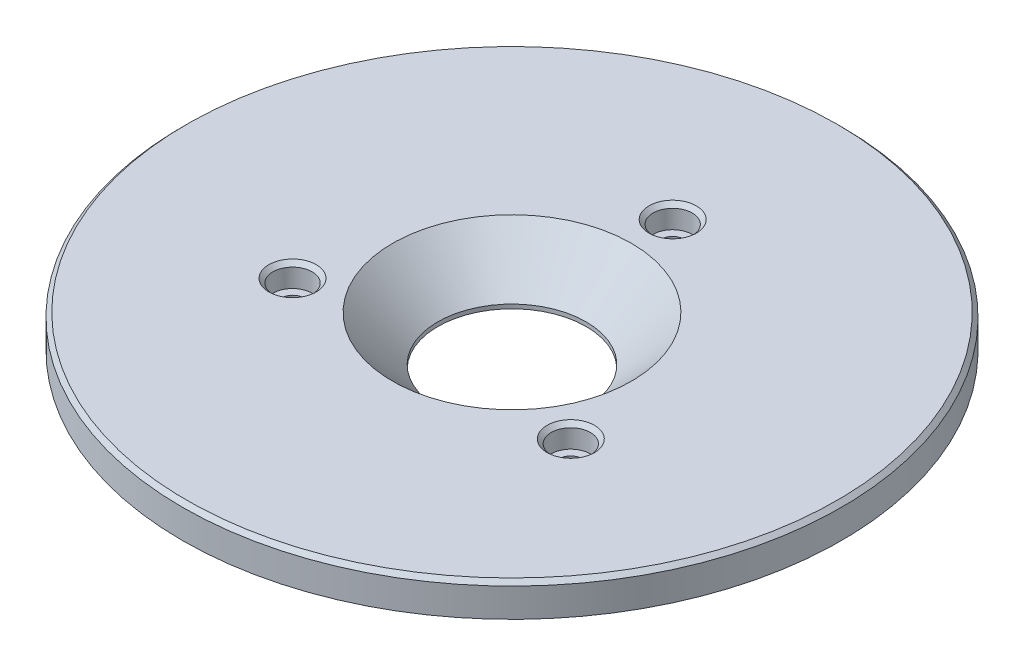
ISO-10303-21;
HEADER;
FILE_DESCRIPTION(('STEP AP214'),'2;1');
FILE_NAME('part.step','',(''),(''),'','','');
FILE_SCHEMA(('AUTOMOTIVE_DESIGN { 1 0 10303 214 1 1 1 1 }'));
ENDSEC;
DATA;
#1=APPLICATION_CONTEXT('core data for automotive mechanical design processes');
#2=APPLICATION_PROTOCOL_DEFINITION('international standard','automotive_design',2000,#1);
#3=PRODUCT_CONTEXT('',#1,'mechanical');
#4=PRODUCT('Part','Part','',(#3));
#5=PRODUCT_RELATED_PRODUCT_CATEGORY('part','',(#4));
#6=PRODUCT_DEFINITION_FORMATION('','',#4);
#7=PRODUCT_DEFINITION_CONTEXT('part definition',#1,'design');
#8=PRODUCT_DEFINITION('design','',#6,#7);
#9=PRODUCT_DEFINITION_SHAPE('','',#8);
#10=(LENGTH_UNIT() NAMED_UNIT(*) SI_UNIT(.MILLI.,.METRE.));
#11=(NAMED_UNIT(*) PLANE_ANGLE_UNIT() SI_UNIT($,.RADIAN.));
#12=(NAMED_UNIT(*) SI_UNIT($,.STERADIAN.) SOLID_ANGLE_UNIT());
#13=UNCERTAINTY_MEASURE_WITH_UNIT(LENGTH_MEASURE(1.E-05),#10,'distance_accuracy_value','');
#14=(GEOMETRIC_REPRESENTATION_CONTEXT(3) GLOBAL_UNCERTAINTY_ASSIGNED_CONTEXT((#13)) GLOBAL_UNIT_ASSIGNED_CONTEXT((#10,
#11,#12)) REPRESENTATION_CONTEXT('',''));
#15=CARTESIAN_POINT('',(0.,0.,0.));
#16=DIRECTION('',(0.,0.,1.));
#17=DIRECTION('',(1.,0.,0.));
#18=AXIS2_PLACEMENT_3D('',#15,#16,#17);
#19=CARTESIAN_POINT('',(-29.,12.,0.));
#20=DIRECTION('',(0.,-1.,0.));
#21=DIRECTION('',(0.,0.,-1.));
#22=AXIS2_PLACEMENT_3D('',#19,#20,#21);
#23=PLANE('',#22);
#24=CARTESIAN_POINT('',(33.7749907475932,12.,19.5));
#25=DIRECTION('',(0.,-1.,0.));
#26=DIRECTION('',(0.,0.,-1.));
#27=AXIS2_PLACEMENT_3D('',#24,#25,#26);
#28=CIRCLE('',#27,5.75);
#29=CARTESIAN_POINT('',(33.7749907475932,12.,13.75));
#30=VERTEX_POINT('',#29);
#31=EDGE_CURVE('E25',#30,#30,#28,.T.);
#32=ORIENTED_EDGE('',*,*,#31,.T.);
#33=EDGE_LOOP('',(#32));
#34=FACE_BOUND('',#33,.T.);
#35=CARTESIAN_POINT('',(0.,12.,-39.));
#36=DIRECTION('',(0.,-1.,0.));
#37=DIRECTION('',(0.,0.,-1.));
#38=AXIS2_PLACEMENT_3D('',#35,#36,#37);
#39=CIRCLE('',#38,5.75);
#40=CARTESIAN_POINT('',(0.,12.,-44.75));
#41=VERTEX_POINT('',#40);
#42=EDGE_CURVE('E29',#41,#41,#39,.T.);
#43=ORIENTED_EDGE('',*,*,#42,.T.);
#44=EDGE_LOOP('',(#43));
#45=FACE_BOUND('',#44,.T.);
#46=CARTESIAN_POINT('',(-33.7749907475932,12.,19.5));
#47=DIRECTION('',(0.,-1.,0.));
#48=DIRECTION('',(0.,0.,-1.));
#49=AXIS2_PLACEMENT_3D('',#46,#47,#48);
#50=CIRCLE('',#49,5.75);
#51=CARTESIAN_POINT('',(-33.7749907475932,12.,13.75));
#52=VERTEX_POINT('',#51);
#53=EDGE_CURVE('E34',#52,#52,#50,.T.);
#54=ORIENTED_EDGE('',*,*,#53,.T.);
#55=EDGE_LOOP('',(#54));
#56=FACE_BOUND('',#55,.T.);
#57=CARTESIAN_POINT('',(0.,12.,0.));
#58=DIRECTION('',(0.,-1.,0.));
#59=DIRECTION('',(0.,0.,-1.));
#60=AXIS2_PLACEMENT_3D('',#57,#58,#59);
#61=CIRCLE('',#60,79.);
#62=CARTESIAN_POINT('',(0.,12.,-79.));
#63=VERTEX_POINT('',#62);
#64=EDGE_CURVE('E58',#63,#63,#61,.F.);
#65=ORIENTED_EDGE('',*,*,#64,.T.);
#66=EDGE_LOOP('',(#65));
#67=FACE_BOUND('',#66,.T.);
#68=CARTESIAN_POINT('',(0.,12.,0.));
#69=DIRECTION('',(0.,-1.,0.));
#70=DIRECTION('',(0.,0.,-1.));
#71=AXIS2_PLACEMENT_3D('',#68,#69,#70);
#72=CIRCLE('',#71,29.);
#73=CARTESIAN_POINT('',(0.,12.,-29.));
#74=VERTEX_POINT('',#73);
#75=EDGE_CURVE('E70',#74,#74,#72,.T.);
#76=ORIENTED_EDGE('',*,*,#75,.T.);
#77=EDGE_LOOP('',(#76));
#78=FACE_BOUND('',#77,.T.);
#79=ADVANCED_FACE('F14',(#34,#45,#56,#67,#78),#23,.F.);
#80=CARTESIAN_POINT('',(0.,1.,0.));
#81=DIRECTION('',(0.,1.,0.));
#82=DIRECTION('',(0.,0.,1.));
#83=AXIS2_PLACEMENT_3D('',#80,#81,#82);
#84=CONICAL_SURFACE('',#83,18.,0.78539816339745);
#85=ORIENTED_EDGE('',*,*,#75,.F.);
#86=EDGE_LOOP('',(#85));
#87=FACE_BOUND('',#86,.T.);
#88=CARTESIAN_POINT('',(0.,1.,0.));
#89=DIRECTION('',(0.,-1.,0.));
#90=DIRECTION('',(0.,0.,-1.));
#91=AXIS2_PLACEMENT_3D('',#88,#89,#90);
#92=CIRCLE('',#91,18.);
#93=CARTESIAN_POINT('',(0.,1.,-18.));
#94=VERTEX_POINT('',#93);
#95=EDGE_CURVE('E83',#94,#94,#92,.T.);
#96=ORIENTED_EDGE('',*,*,#95,.T.);
#97=EDGE_LOOP('',(#96));
#98=FACE_BOUND('',#97,.T.);
#99=ADVANCED_FACE('F123',(#87,#98),#84,.F.);
#100=CARTESIAN_POINT('',(0.,0.,0.));
#101=DIRECTION('',(0.,-1.,0.));
#102=DIRECTION('',(0.,0.,-1.));
#103=AXIS2_PLACEMENT_3D('',#100,#101,#102);
#104=CYLINDRICAL_SURFACE('',#103,18.);
#105=ORIENTED_EDGE('',*,*,#95,.F.);
#106=EDGE_LOOP('',(#105));
#107=FACE_BOUND('',#106,.T.);
#108=CARTESIAN_POINT('',(0.,0.,0.));
#109=DIRECTION('',(0.,-1.,0.));
#110=DIRECTION('',(0.,0.,-1.));
#111=AXIS2_PLACEMENT_3D('',#108,#109,#110);
#112=CIRCLE('',#111,18.);
#113=CARTESIAN_POINT('',(0.,0.,-18.));
#114=VERTEX_POINT('',#113);
#115=EDGE_CURVE('E86',#114,#114,#112,.T.);
#116=ORIENTED_EDGE('',*,*,#115,.T.);
#117=EDGE_LOOP('',(#116));
#118=FACE_BOUND('',#117,.T.);
#119=ADVANCED_FACE('F130',(#107,#118),#104,.F.);
#120=CARTESIAN_POINT('',(-18.,0.,0.));
#121=DIRECTION('',(0.,1.,0.));
#122=DIRECTION('',(0.,0.,1.));
#123=AXIS2_PLACEMENT_3D('',#120,#121,#122);
#124=PLANE('',#123);
#125=CARTESIAN_POINT('',(-33.7749907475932,0.,19.5));
#126=DIRECTION('',(0.,1.,0.));
#127=DIRECTION('',(0.,0.,1.));
#128=AXIS2_PLACEMENT_3D('',#125,#126,#127);
#129=CIRCLE('',#128,3.75);
#130=CARTESIAN_POINT('',(-33.7749907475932,0.,23.25));
#131=VERTEX_POINT('',#130);
#132=EDGE_CURVE('E49',#131,#131,#129,.T.);
#133=ORIENTED_EDGE('',*,*,#132,.T.);
#134=EDGE_LOOP('',(#133));
#135=FACE_BOUND('',#134,.T.);
#136=CARTESIAN_POINT('',(33.7749907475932,0.,19.5));
#137=DIRECTION('',(0.,1.,0.));
#138=DIRECTION('',(0.,0.,1.));
#139=AXIS2_PLACEMENT_3D('',#136,#137,#138);
#140=CIRCLE('',#139,3.75);
#141=CARTESIAN_POINT('',(33.7749907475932,0.,23.25));
#142=VERTEX_POINT('',#141);
#143=EDGE_CURVE('E52',#142,#142,#140,.T.);
#144=ORIENTED_EDGE('',*,*,#143,.T.);
#145=EDGE_LOOP('',(#144));
#146=FACE_BOUND('',#145,.T.);
#147=CARTESIAN_POINT('',(0.,0.,-39.));
#148=DIRECTION('',(0.,1.,0.));
#149=DIRECTION('',(0.,0.,1.));
#150=AXIS2_PLACEMENT_3D('',#147,#148,#149);
#151=CIRCLE('',#150,3.75);
#152=CARTESIAN_POINT('',(0.,0.,-35.25));
#153=VERTEX_POINT('',#152);
#154=EDGE_CURVE('E55',#153,#153,#151,.T.);
#155=ORIENTED_EDGE('',*,*,#154,.T.);
#156=EDGE_LOOP('',(#155));
#157=FACE_BOUND('',#156,.T.);
#158=CARTESIAN_POINT('',(0.,0.,0.));
#159=DIRECTION('',(0.,1.,0.));
#160=DIRECTION('',(0.,0.,1.));
#161=AXIS2_PLACEMENT_3D('',#158,#159,#160);
#162=CIRCLE('',#161,44.);
#163=CARTESIAN_POINT('',(0.,0.,44.));
#164=VERTEX_POINT('',#163);
#165=EDGE_CURVE('E67',#164,#164,#162,.F.);
#166=ORIENTED_EDGE('',*,*,#165,.T.);
#167=EDGE_LOOP('',(#166));
#168=FACE_BOUND('',#167,.T.);
#169=ORIENTED_EDGE('',*,*,#115,.F.);
#170=EDGE_LOOP('',(#169));
#171=FACE_BOUND('',#170,.T.);
#172=ADVANCED_FACE('F181',(#135,#146,#157,#168,#171),#124,.F.);
#173=CARTESIAN_POINT('',(0.,0.,0.));
#174=DIRECTION('',(0.,-1.,0.));
#175=DIRECTION('',(0.,0.,-1.));
#176=AXIS2_PLACEMENT_3D('',#173,#174,#175);
#177=CYLINDRICAL_SURFACE('',#176,45.);
#178=CARTESIAN_POINT('',(0.,1.00000000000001,0.));
#179=DIRECTION('',(0.,1.,0.));
#180=DIRECTION('',(0.,0.,1.));
#181=AXIS2_PLACEMENT_3D('',#178,#179,#180);
#182=CIRCLE('',#181,45.);
#183=CARTESIAN_POINT('',(0.,1.00000000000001,45.));
#184=VERTEX_POINT('',#183);
#185=EDGE_CURVE('E64',#184,#184,#182,.T.);
#186=ORIENTED_EDGE('',*,*,#185,.T.);
#187=EDGE_LOOP('',(#186));
#188=FACE_BOUND('',#187,.T.);
#189=CARTESIAN_POINT('',(0.,4.,0.));
#190=DIRECTION('',(0.,-1.,0.));
#191=DIRECTION('',(0.,0.,-1.));
#192=AXIS2_PLACEMENT_3D('',#189,#190,#191);
#193=CIRCLE('',#192,45.);
#194=CARTESIAN_POINT('',(0.,4.,-45.));
#195=VERTEX_POINT('',#194);
#196=EDGE_CURVE('E89',#195,#195,#193,.T.);
#197=ORIENTED_EDGE('',*,*,#196,.T.);
#198=EDGE_LOOP('',(#197));
#199=FACE_BOUND('',#198,.T.);
#200=ADVANCED_FACE('F185',(#188,#199),#177,.T.);
#201=CARTESIAN_POINT('',(-45.,4.,0.));
#202=DIRECTION('',(0.,1.,0.));
#203=DIRECTION('',(0.,0.,1.));
#204=AXIS2_PLACEMENT_3D('',#201,#202,#203);
#205=PLANE('',#204);
#206=ORIENTED_EDGE('',*,*,#196,.F.);
#207=EDGE_LOOP('',(#206));
#208=FACE_BOUND('',#207,.T.);
#209=CARTESIAN_POINT('',(0.,4.,0.));
#210=DIRECTION('',(0.,-1.,0.));
#211=DIRECTION('',(0.,0.,-1.));
#212=AXIS2_PLACEMENT_3D('',#209,#210,#211);
#213=CIRCLE('',#212,80.);
#214=CARTESIAN_POINT('',(0.,4.,-80.));
#215=VERTEX_POINT('',#214);
#216=EDGE_CURVE('E92',#215,#215,#213,.T.);
#217=ORIENTED_EDGE('',*,*,#216,.T.);
#218=EDGE_LOOP('',(#217));
#219=FACE_BOUND('',#218,.T.);
#220=ADVANCED_FACE('F192',(#208,#219),#205,.F.);
#221=CARTESIAN_POINT('',(0.,0.,0.));
#222=DIRECTION('',(0.,-1.,0.));
#223=DIRECTION('',(0.,0.,-1.));
#224=AXIS2_PLACEMENT_3D('',#221,#222,#223);
#225=CYLINDRICAL_SURFACE('',#224,80.);
#226=CARTESIAN_POINT('',(0.,11.,0.));
#227=DIRECTION('',(0.,-1.,0.));
#228=DIRECTION('',(0.,0.,-1.));
#229=AXIS2_PLACEMENT_3D('',#226,#227,#228);
#230=CIRCLE('',#229,80.);
#231=CARTESIAN_POINT('',(0.,11.,-80.));
#232=VERTEX_POINT('',#231);
#233=EDGE_CURVE('E61',#232,#232,#230,.T.);
#234=ORIENTED_EDGE('',*,*,#233,.T.);
#235=EDGE_LOOP('',(#234));
#236=FACE_BOUND('',#235,.T.);
#237=ORIENTED_EDGE('',*,*,#216,.F.);
#238=EDGE_LOOP('',(#237));
#239=FACE_BOUND('',#238,.T.);
#240=ADVANCED_FACE('F199',(#236,#239),#225,.T.);
#241=CARTESIAN_POINT('',(33.7749907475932,6.5,19.5));
#242=DIRECTION('',(0.,1.,0.));
#243=DIRECTION('',(0.,0.,1.));
#244=AXIS2_PLACEMENT_3D('',#241,#242,#243);
#245=CYLINDRICAL_SURFACE('',#244,4.75);
#246=CARTESIAN_POINT('',(33.7749907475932,11.,19.5));
#247=DIRECTION('',(0.,-1.,0.));
#248=DIRECTION('',(0.,0.,-1.));
#249=AXIS2_PLACEMENT_3D('',#246,#247,#248);
#250=CIRCLE('',#249,4.75);
#251=CARTESIAN_POINT('',(33.7749907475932,11.,14.75));
#252=VERTEX_POINT('',#251);
#253=EDGE_CURVE('E37',#252,#252,#250,.F.);
#254=ORIENTED_EDGE('',*,*,#253,.T.);
#255=EDGE_LOOP('',(#254));
#256=FACE_BOUND('',#255,.T.);
#257=CARTESIAN_POINT('',(33.7749907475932,6.5,19.5));
#258=DIRECTION('',(0.,1.,0.));
#259=DIRECTION('',(0.,0.,-1.));
#260=AXIS2_PLACEMENT_3D('',#257,#258,#259);
#261=CIRCLE('',#260,4.75);
#262=CARTESIAN_POINT('',(33.7749907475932,6.5,14.75));
#263=VERTEX_POINT('',#262);
#264=EDGE_CURVE('E74',#263,#263,#261,.T.);
#265=ORIENTED_EDGE('',*,*,#264,.F.);
#266=EDGE_LOOP('',(#265));
#267=FACE_BOUND('',#266,.T.);
#268=ADVANCED_FACE('F203',(#256,#267),#245,.F.);
#269=CARTESIAN_POINT('',(33.7749907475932,6.5,19.5));
#270=DIRECTION('',(0.,-1.,0.));
#271=DIRECTION('',(0.,0.,-1.));
#272=AXIS2_PLACEMENT_3D('',#269,#270,#271);
#273=PLANE('',#272);
#274=CARTESIAN_POINT('',(33.7749907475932,6.5,19.5));
#275=DIRECTION('',(0.,-1.,0.));
#276=DIRECTION('',(0.,0.,-1.));
#277=AXIS2_PLACEMENT_3D('',#274,#275,#276);
#278=CIRCLE('',#277,2.75);
#279=CARTESIAN_POINT('',(33.7749907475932,6.5,16.75));
#280=VERTEX_POINT('',#279);
#281=EDGE_CURVE('E71',#280,#280,#278,.T.);
#282=ORIENTED_EDGE('',*,*,#281,.T.);
#283=EDGE_LOOP('',(#282));
#284=FACE_BOUND('',#283,.T.);
#285=ORIENTED_EDGE('',*,*,#264,.T.);
#286=EDGE_LOOP('',(#285));
#287=FACE_BOUND('',#286,.T.);
#288=ADVANCED_FACE('F207',(#284,#287),#273,.F.);
#289=CARTESIAN_POINT('',(-33.7749907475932,6.5,19.5));
#290=DIRECTION('',(0.,1.,0.));
#291=DIRECTION('',(0.,0.,1.));
#292=AXIS2_PLACEMENT_3D('',#289,#290,#291);
#293=CYLINDRICAL_SURFACE('',#292,4.75);
#294=CARTESIAN_POINT('',(-33.7749907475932,11.,19.5));
#295=DIRECTION('',(0.,-1.,0.));
#296=DIRECTION('',(0.,0.,-1.));
#297=AXIS2_PLACEMENT_3D('',#294,#295,#296);
#298=CIRCLE('',#297,4.75);
#299=CARTESIAN_POINT('',(-33.7749907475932,11.,14.75));
#300=VERTEX_POINT('',#299);
#301=EDGE_CURVE('E9',#300,#300,#298,.F.);
#302=ORIENTED_EDGE('',*,*,#301,.T.);
#303=EDGE_LOOP('',(#302));
#304=FACE_BOUND('',#303,.T.);
#305=CARTESIAN_POINT('',(-33.7749907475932,6.5,19.5));
#306=DIRECTION('',(0.,1.,0.));
#307=DIRECTION('',(0.,0.,1.));
#308=AXIS2_PLACEMENT_3D('',#305,#306,#307);
#309=CIRCLE('',#308,4.75);
#310=CARTESIAN_POINT('',(-33.7749907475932,6.5,24.25));
#311=VERTEX_POINT('',#310);
#312=EDGE_CURVE('E98',#311,#311,#309,.T.);
#313=ORIENTED_EDGE('',*,*,#312,.F.);
#314=EDGE_LOOP('',(#313));
#315=FACE_BOUND('',#314,.T.);
#316=ADVANCED_FACE('F119',(#304,#315),#293,.F.);
#317=CARTESIAN_POINT('',(-33.7749907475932,6.5,19.5));
#318=DIRECTION('',(0.,1.,0.));
#319=DIRECTION('',(0.,0.,1.));
#320=AXIS2_PLACEMENT_3D('',#317,#318,#319);
#321=PLANE('',#320);
#322=CARTESIAN_POINT('',(-33.7749907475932,6.5,19.5));
#323=DIRECTION('',(0.,1.,0.));
#324=DIRECTION('',(0.,0.,1.));
#325=AXIS2_PLACEMENT_3D('',#322,#323,#324);
#326=CIRCLE('',#325,2.75);
#327=CARTESIAN_POINT('',(-33.7749907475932,6.5,22.25));
#328=VERTEX_POINT('',#327);
#329=EDGE_CURVE('E75',#328,#328,#326,.T.);
#330=ORIENTED_EDGE('',*,*,#329,.F.);
#331=EDGE_LOOP('',(#330));
#332=FACE_BOUND('',#331,.T.);
#333=ORIENTED_EDGE('',*,*,#312,.T.);
#334=EDGE_LOOP('',(#333));
#335=FACE_BOUND('',#334,.T.);
#336=ADVANCED_FACE('F108',(#332,#335),#321,.T.);
#337=CARTESIAN_POINT('',(0.,6.5,-39.));
#338=DIRECTION('',(0.,1.,0.));
#339=DIRECTION('',(0.,0.,1.));
#340=AXIS2_PLACEMENT_3D('',#337,#338,#339);
#341=CYLINDRICAL_SURFACE('',#340,4.75);
#342=CARTESIAN_POINT('',(0.,11.,-39.));
#343=DIRECTION('',(0.,-1.,0.));
#344=DIRECTION('',(0.,0.,-1.));
#345=AXIS2_PLACEMENT_3D('',#342,#343,#344);
#346=CIRCLE('',#345,4.75);
#347=CARTESIAN_POINT('',(0.,11.,-43.75));
#348=VERTEX_POINT('',#347);
#349=EDGE_CURVE('E21',#348,#348,#346,.F.);
#350=ORIENTED_EDGE('',*,*,#349,.T.);
#351=EDGE_LOOP('',(#350));
#352=FACE_BOUND('',#351,.T.);
#353=CARTESIAN_POINT('',(0.,6.5,-39.));
#354=DIRECTION('',(0.,1.,0.));
#355=DIRECTION('',(0.,0.,1.));
#356=AXIS2_PLACEMENT_3D('',#353,#354,#355);
#357=CIRCLE('',#356,4.75);
#358=CARTESIAN_POINT('',(0.,6.5,-34.25));
#359=VERTEX_POINT('',#358);
#360=EDGE_CURVE('E95',#359,#359,#357,.T.);
#361=ORIENTED_EDGE('',*,*,#360,.F.);
#362=EDGE_LOOP('',(#361));
#363=FACE_BOUND('',#362,.T.);
#364=ADVANCED_FACE('F106',(#352,#363),#341,.F.);
#365=CARTESIAN_POINT('',(0.,6.5,-39.));
#366=DIRECTION('',(0.,1.,0.));
#367=DIRECTION('',(0.,0.,1.));
#368=AXIS2_PLACEMENT_3D('',#365,#366,#367);
#369=PLANE('',#368);
#370=CARTESIAN_POINT('',(0.,6.5,-39.));
#371=DIRECTION('',(0.,1.,0.));
#372=DIRECTION('',(0.,0.,1.));
#373=AXIS2_PLACEMENT_3D('',#370,#371,#372);
#374=CIRCLE('',#373,2.75);
#375=CARTESIAN_POINT('',(0.,6.5,-36.25));
#376=VERTEX_POINT('',#375);
#377=EDGE_CURVE('E78',#376,#376,#374,.T.);
#378=ORIENTED_EDGE('',*,*,#377,.F.);
#379=EDGE_LOOP('',(#378));
#380=FACE_BOUND('',#379,.T.);
#381=ORIENTED_EDGE('',*,*,#360,.T.);
#382=EDGE_LOOP('',(#381));
#383=FACE_BOUND('',#382,.T.);
#384=ADVANCED_FACE('F104',(#380,#383),#369,.T.);
#385=CARTESIAN_POINT('',(0.,0.,-39.));
#386=DIRECTION('',(0.,1.,0.));
#387=DIRECTION('',(0.,0.,1.));
#388=AXIS2_PLACEMENT_3D('',#385,#386,#387);
#389=CYLINDRICAL_SURFACE('',#388,2.75);
#390=CARTESIAN_POINT('',(0.,1.,-39.));
#391=DIRECTION('',(0.,1.,0.));
#392=DIRECTION('',(0.,0.,1.));
#393=AXIS2_PLACEMENT_3D('',#390,#391,#392);
#394=CIRCLE('',#393,2.75);
#395=CARTESIAN_POINT('',(0.,1.,-36.25));
#396=VERTEX_POINT('',#395);
#397=EDGE_CURVE('E40',#396,#396,#394,.F.);
#398=ORIENTED_EDGE('',*,*,#397,.T.);
#399=EDGE_LOOP('',(#398));
#400=FACE_BOUND('',#399,.T.);
#401=ORIENTED_EDGE('',*,*,#377,.T.);
#402=EDGE_LOOP('',(#401));
#403=FACE_BOUND('',#402,.T.);
#404=ADVANCED_FACE('F116',(#400,#403),#389,.F.);
#405=CARTESIAN_POINT('',(-33.7749907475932,0.,19.5));
#406=DIRECTION('',(0.,1.,0.));
#407=DIRECTION('',(0.,0.,1.));
#408=AXIS2_PLACEMENT_3D('',#405,#406,#407);
#409=CYLINDRICAL_SURFACE('',#408,2.75);
#410=CARTESIAN_POINT('',(-33.7749907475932,1.,19.5));
#411=DIRECTION('',(0.,1.,0.));
#412=DIRECTION('',(0.,0.,1.));
#413=AXIS2_PLACEMENT_3D('',#410,#411,#412);
#414=CIRCLE('',#413,2.75);
#415=CARTESIAN_POINT('',(-33.7749907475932,1.,22.25));
#416=VERTEX_POINT('',#415);
#417=EDGE_CURVE('E46',#416,#416,#414,.F.);
#418=ORIENTED_EDGE('',*,*,#417,.T.);
#419=EDGE_LOOP('',(#418));
#420=FACE_BOUND('',#419,.T.);
#421=ORIENTED_EDGE('',*,*,#329,.T.);
#422=EDGE_LOOP('',(#421));
#423=FACE_BOUND('',#422,.T.);
#424=ADVANCED_FACE('F338',(#420,#423),#409,.F.);
#425=CARTESIAN_POINT('',(33.7749907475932,0.,19.5));
#426=DIRECTION('',(0.,1.,0.));
#427=DIRECTION('',(0.,0.,1.));
#428=AXIS2_PLACEMENT_3D('',#425,#426,#427);
#429=CYLINDRICAL_SURFACE('',#428,2.75);
#430=CARTESIAN_POINT('',(33.7749907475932,1.,19.5));
#431=DIRECTION('',(0.,1.,0.));
#432=DIRECTION('',(0.,0.,1.));
#433=AXIS2_PLACEMENT_3D('',#430,#431,#432);
#434=CIRCLE('',#433,2.75);
#435=CARTESIAN_POINT('',(33.7749907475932,1.,22.25));
#436=VERTEX_POINT('',#435);
#437=EDGE_CURVE('E43',#436,#436,#434,.F.);
#438=ORIENTED_EDGE('',*,*,#437,.T.);
#439=EDGE_LOOP('',(#438));
#440=FACE_BOUND('',#439,.T.);
#441=ORIENTED_EDGE('',*,*,#281,.F.);
#442=EDGE_LOOP('',(#441));
#443=FACE_BOUND('',#442,.T.);
#444=ADVANCED_FACE('F140',(#440,#443),#429,.F.);
#445=CARTESIAN_POINT('',(0.,0.,0.));
#446=DIRECTION('',(0.,1.,0.));
#447=DIRECTION('',(0.,0.,1.));
#448=AXIS2_PLACEMENT_3D('',#445,#446,#447);
#449=CONICAL_SURFACE('',#448,44.,0.785398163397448);
#450=ORIENTED_EDGE('',*,*,#185,.F.);
#451=EDGE_LOOP('',(#450));
#452=FACE_BOUND('',#451,.T.);
#453=ORIENTED_EDGE('',*,*,#165,.F.);
#454=EDGE_LOOP('',(#453));
#455=FACE_BOUND('',#454,.T.);
#456=ADVANCED_FACE('F136',(#452,#455),#449,.T.);
#457=CARTESIAN_POINT('',(0.,11.,0.));
#458=DIRECTION('',(0.,-1.,0.));
#459=DIRECTION('',(0.,0.,-1.));
#460=AXIS2_PLACEMENT_3D('',#457,#458,#459);
#461=CONICAL_SURFACE('',#460,80.,0.785398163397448);
#462=ORIENTED_EDGE('',*,*,#64,.F.);
#463=EDGE_LOOP('',(#462));
#464=FACE_BOUND('',#463,.T.);
#465=ORIENTED_EDGE('',*,*,#233,.F.);
#466=EDGE_LOOP('',(#465));
#467=FACE_BOUND('',#466,.T.);
#468=ADVANCED_FACE('F139',(#464,#467),#461,.T.);
#469=CARTESIAN_POINT('',(-33.7749907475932,0.,19.5));
#470=DIRECTION('',(0.,-1.,0.));
#471=DIRECTION('',(0.,0.,-1.));
#472=AXIS2_PLACEMENT_3D('',#469,#470,#471);
#473=CONICAL_SURFACE('',#472,3.75,0.785398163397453);
#474=ORIENTED_EDGE('',*,*,#417,.F.);
#475=EDGE_LOOP('',(#474));
#476=FACE_BOUND('',#475,.T.);
#477=ORIENTED_EDGE('',*,*,#132,.F.);
#478=EDGE_LOOP('',(#477));
#479=FACE_BOUND('',#478,.T.);
#480=ADVANCED_FACE('F144',(#476,#479),#473,.F.);
#481=CARTESIAN_POINT('',(33.7749907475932,0.,19.5));
#482=DIRECTION('',(0.,-1.,0.));
#483=DIRECTION('',(0.,0.,-1.));
#484=AXIS2_PLACEMENT_3D('',#481,#482,#483);
#485=CONICAL_SURFACE('',#484,3.75,0.785398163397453);
#486=ORIENTED_EDGE('',*,*,#437,.F.);
#487=EDGE_LOOP('',(#486));
#488=FACE_BOUND('',#487,.T.);
#489=ORIENTED_EDGE('',*,*,#143,.F.);
#490=EDGE_LOOP('',(#489));
#491=FACE_BOUND('',#490,.T.);
#492=ADVANCED_FACE('F148',(#488,#491),#485,.F.);
#493=CARTESIAN_POINT('',(0.,0.,-39.));
#494=DIRECTION('',(0.,-1.,0.));
#495=DIRECTION('',(0.,0.,-1.));
#496=AXIS2_PLACEMENT_3D('',#493,#494,#495);
#497=CONICAL_SURFACE('',#496,3.75,0.785398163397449);
#498=ORIENTED_EDGE('',*,*,#397,.F.);
#499=EDGE_LOOP('',(#498));
#500=FACE_BOUND('',#499,.T.);
#501=ORIENTED_EDGE('',*,*,#154,.F.);
#502=EDGE_LOOP('',(#501));
#503=FACE_BOUND('',#502,.T.);
#504=ADVANCED_FACE('F152',(#500,#503),#497,.F.);
#505=CARTESIAN_POINT('',(33.7749907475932,11.,19.5));
#506=DIRECTION('',(0.,1.,0.));
#507=DIRECTION('',(0.,0.,1.));
#508=AXIS2_PLACEMENT_3D('',#505,#506,#507);
#509=CONICAL_SURFACE('',#508,4.75,0.785398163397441);
#510=ORIENTED_EDGE('',*,*,#31,.F.);
#511=EDGE_LOOP('',(#510));
#512=FACE_BOUND('',#511,.T.);
#513=ORIENTED_EDGE('',*,*,#253,.F.);
#514=EDGE_LOOP('',(#513));
#515=FACE_BOUND('',#514,.T.);
#516=ADVANCED_FACE('F156',(#512,#515),#509,.F.);
#517=CARTESIAN_POINT('',(0.,11.,-39.));
#518=DIRECTION('',(0.,1.,0.));
#519=DIRECTION('',(0.,0.,1.));
#520=AXIS2_PLACEMENT_3D('',#517,#518,#519);
#521=CONICAL_SURFACE('',#520,4.75,0.785398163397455);
#522=ORIENTED_EDGE('',*,*,#42,.F.);
#523=EDGE_LOOP('',(#522));
#524=FACE_BOUND('',#523,.T.);
#525=ORIENTED_EDGE('',*,*,#349,.F.);
#526=EDGE_LOOP('',(#525));
#527=FACE_BOUND('',#526,.T.);
#528=ADVANCED_FACE('F159',(#524,#527),#521,.F.);
#529=CARTESIAN_POINT('',(-33.7749907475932,11.,19.5));
#530=DIRECTION('',(0.,1.,0.));
#531=DIRECTION('',(0.,0.,1.));
#532=AXIS2_PLACEMENT_3D('',#529,#530,#531);
#533=CONICAL_SURFACE('',#532,4.75,0.785398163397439);
#534=ORIENTED_EDGE('',*,*,#53,.F.);
#535=EDGE_LOOP('',(#534));
#536=FACE_BOUND('',#535,.T.);
#537=ORIENTED_EDGE('',*,*,#301,.F.);
#538=EDGE_LOOP('',(#537));
#539=FACE_BOUND('',#538,.T.);
#540=ADVANCED_FACE('F16',(#536,#539),#533,.F.);
#541=CLOSED_SHELL('',(#79,#99,#119,#172,#200,#220,#240,#268,#288,#316,#336,#364,#384,#404,#424,
#444,#456,#468,#480,#492,#504,#516,#528,#540));
#542=MANIFOLD_SOLID_BREP('B1',#541);
#543=ADVANCED_BREP_SHAPE_REPRESENTATION('',(#18,#542),#14);
#544=SHAPE_DEFINITION_REPRESENTATION(#9,#543);
ENDSEC;
END-ISO-10303-21;
